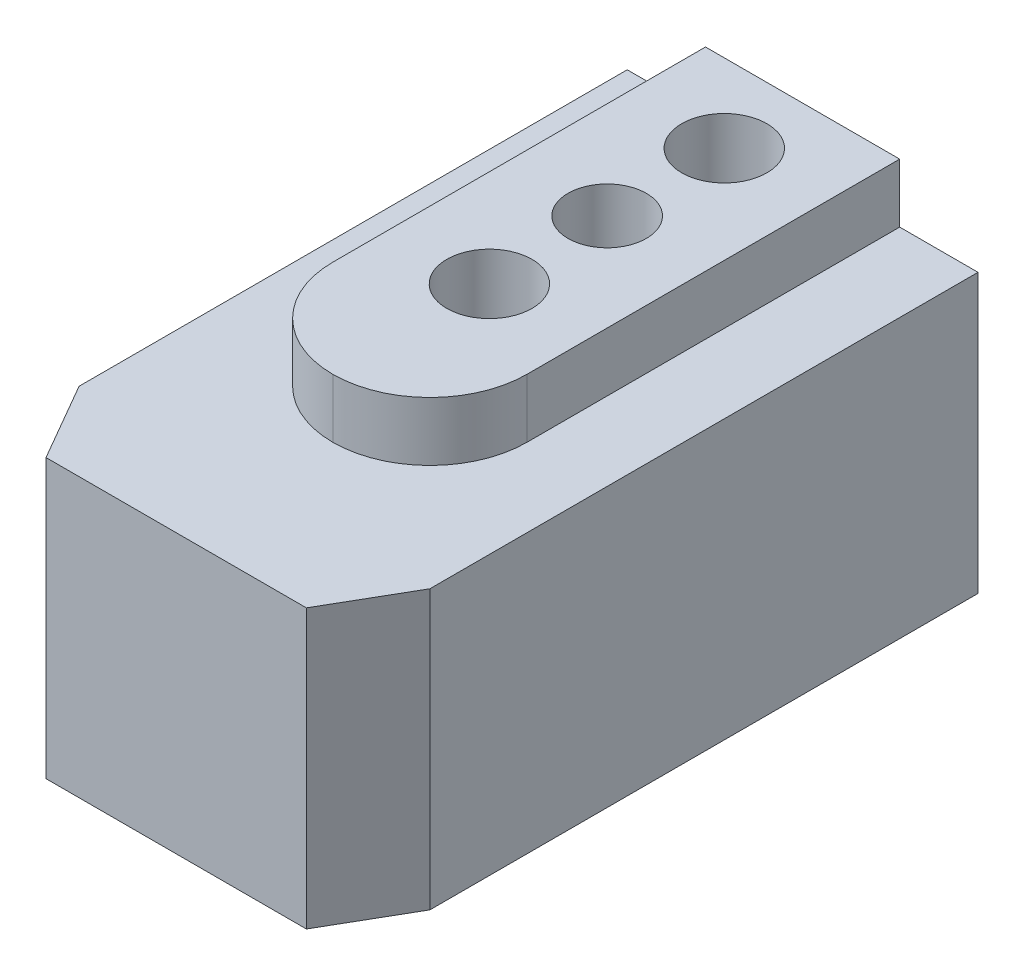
ISO-10303-21;
HEADER;
FILE_DESCRIPTION(('STEP AP214'),'2;1');
FILE_NAME('part.step','',(''),(''),'','','');
FILE_SCHEMA(('AUTOMOTIVE_DESIGN { 1 0 10303 214 1 1 1 1 }'));
ENDSEC;
DATA;
#1=APPLICATION_CONTEXT('core data for automotive mechanical design processes');
#2=APPLICATION_PROTOCOL_DEFINITION('international standard','automotive_design',2000,#1);
#3=PRODUCT_CONTEXT('',#1,'mechanical');
#4=PRODUCT('Part','Part','',(#3));
#5=PRODUCT_RELATED_PRODUCT_CATEGORY('part','',(#4));
#6=PRODUCT_DEFINITION_FORMATION('','',#4);
#7=PRODUCT_DEFINITION_CONTEXT('part definition',#1,'design');
#8=PRODUCT_DEFINITION('design','',#6,#7);
#9=PRODUCT_DEFINITION_SHAPE('','',#8);
#10=(LENGTH_UNIT() NAMED_UNIT(*) SI_UNIT(.MILLI.,.METRE.));
#11=(NAMED_UNIT(*) PLANE_ANGLE_UNIT() SI_UNIT($,.RADIAN.));
#12=(NAMED_UNIT(*) SI_UNIT($,.STERADIAN.) SOLID_ANGLE_UNIT());
#13=UNCERTAINTY_MEASURE_WITH_UNIT(LENGTH_MEASURE(1.E-05),#10,'distance_accuracy_value','');
#14=(GEOMETRIC_REPRESENTATION_CONTEXT(3) GLOBAL_UNCERTAINTY_ASSIGNED_CONTEXT((#13)) GLOBAL_UNIT_ASSIGNED_CONTEXT((#10,
#11,#12)) REPRESENTATION_CONTEXT('',''));
#15=CARTESIAN_POINT('',(0.,0.,0.));
#16=DIRECTION('',(0.,0.,1.));
#17=DIRECTION('',(1.,0.,0.));
#18=AXIS2_PLACEMENT_3D('',#15,#16,#17);
#19=CARTESIAN_POINT('',(-7.112,5.6388,-12.7));
#20=DIRECTION('',(1.,0.,0.));
#21=DIRECTION('',(0.,0.,-1.));
#22=AXIS2_PLACEMENT_3D('',#19,#20,#21);
#23=PLANE('',#22);
#24=DIRECTION('',(0.,0.,1.));
#25=VECTOR('',#24,1.);
#26=CARTESIAN_POINT('',(-7.112,-5.6388,-12.7));
#27=LINE('',#26,#25);
#28=CARTESIAN_POINT('',(-7.112,-5.6388,-12.7));
#29=VERTEX_POINT('',#28);
#30=CARTESIAN_POINT('',(-7.112,-5.6388,9.52499999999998));
#31=VERTEX_POINT('',#30);
#32=EDGE_CURVE('E228',#29,#31,#27,.T.);
#33=ORIENTED_EDGE('',*,*,#32,.T.);
#34=DIRECTION('',(0.,1.,0.));
#35=VECTOR('',#34,1.);
#36=CARTESIAN_POINT('',(-7.112,5.6388,9.52499999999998));
#37=LINE('',#36,#35);
#38=CARTESIAN_POINT('',(-7.11199999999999,5.6388,9.52500000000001));
#39=VERTEX_POINT('',#38);
#40=EDGE_CURVE('E45',#31,#39,#37,.T.);
#41=ORIENTED_EDGE('',*,*,#40,.T.);
#42=DIRECTION('',(0.,0.,1.));
#43=VECTOR('',#42,1.);
#44=CARTESIAN_POINT('',(-7.112,5.6388,-12.7));
#45=LINE('',#44,#43);
#46=CARTESIAN_POINT('',(-7.112,5.6388,-12.7));
#47=VERTEX_POINT('',#46);
#48=EDGE_CURVE('E186',#47,#39,#45,.T.);
#49=ORIENTED_EDGE('',*,*,#48,.F.);
#50=DIRECTION('',(0.,-1.,0.));
#51=VECTOR('',#50,1.);
#52=CARTESIAN_POINT('',(-7.112,5.6388,-12.7));
#53=LINE('',#52,#51);
#54=EDGE_CURVE('E237',#47,#29,#53,.T.);
#55=ORIENTED_EDGE('',*,*,#54,.T.);
#56=EDGE_LOOP('',(#33,#41,#49,#55));
#57=FACE_BOUND('',#56,.T.);
#58=ADVANCED_FACE('F37',(#57),#23,.F.);
#59=CARTESIAN_POINT('',(-7.112,5.6388,12.7));
#60=DIRECTION('',(0.,0.,-1.));
#61=DIRECTION('',(-1.,0.,0.));
#62=AXIS2_PLACEMENT_3D('',#59,#60,#61);
#63=PLANE('',#62);
#64=DIRECTION('',(1.,0.,0.));
#65=VECTOR('',#64,1.);
#66=CARTESIAN_POINT('',(-7.112,5.6388,12.7));
#67=LINE('',#66,#65);
#68=CARTESIAN_POINT('',(-5.27891289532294,5.6388,12.7));
#69=VERTEX_POINT('',#68);
#70=CARTESIAN_POINT('',(5.27891289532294,5.6388,12.7));
#71=VERTEX_POINT('',#70);
#72=EDGE_CURVE('E221',#69,#71,#67,.T.);
#73=ORIENTED_EDGE('',*,*,#72,.F.);
#74=DIRECTION('',(0.,-1.,0.));
#75=VECTOR('',#74,1.);
#76=CARTESIAN_POINT('',(-5.27891289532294,5.6388,12.7));
#77=LINE('',#76,#75);
#78=CARTESIAN_POINT('',(-5.27891289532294,-5.6388,12.7));
#79=VERTEX_POINT('',#78);
#80=EDGE_CURVE('E213',#69,#79,#77,.T.);
#81=ORIENTED_EDGE('',*,*,#80,.T.);
#82=DIRECTION('',(1.,0.,0.));
#83=VECTOR('',#82,1.);
#84=CARTESIAN_POINT('',(-7.112,-5.6388,12.7));
#85=LINE('',#84,#83);
#86=CARTESIAN_POINT('',(5.27891289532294,-5.6388,12.7));
#87=VERTEX_POINT('',#86);
#88=EDGE_CURVE('E220',#79,#87,#85,.T.);
#89=ORIENTED_EDGE('',*,*,#88,.T.);
#90=DIRECTION('',(0.,1.,0.));
#91=VECTOR('',#90,1.);
#92=CARTESIAN_POINT('',(5.27891289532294,5.6388,12.7));
#93=LINE('',#92,#91);
#94=EDGE_CURVE('E208',#87,#71,#93,.T.);
#95=ORIENTED_EDGE('',*,*,#94,.T.);
#96=EDGE_LOOP('',(#73,#81,#89,#95));
#97=FACE_BOUND('',#96,.T.);
#98=ADVANCED_FACE('F219',(#97),#63,.F.);
#99=CARTESIAN_POINT('',(7.112,5.6388,-12.7));
#100=DIRECTION('',(-1.,0.,0.));
#101=DIRECTION('',(0.,0.,1.));
#102=AXIS2_PLACEMENT_3D('',#99,#100,#101);
#103=PLANE('',#102);
#104=DIRECTION('',(0.,0.,-1.));
#105=VECTOR('',#104,1.);
#106=CARTESIAN_POINT('',(7.112,5.6388,-12.7));
#107=LINE('',#106,#105);
#108=CARTESIAN_POINT('',(7.11200000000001,5.6388,9.52499999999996));
#109=VERTEX_POINT('',#108);
#110=CARTESIAN_POINT('',(7.112,5.6388,-12.7));
#111=VERTEX_POINT('',#110);
#112=EDGE_CURVE('E251',#109,#111,#107,.T.);
#113=ORIENTED_EDGE('',*,*,#112,.F.);
#114=DIRECTION('',(0.,-1.,0.));
#115=VECTOR('',#114,1.);
#116=CARTESIAN_POINT('',(7.112,5.6388,9.52499999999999));
#117=LINE('',#116,#115);
#118=CARTESIAN_POINT('',(7.11200000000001,-5.6388,9.52499999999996));
#119=VERTEX_POINT('',#118);
#120=EDGE_CURVE('E200',#109,#119,#117,.T.);
#121=ORIENTED_EDGE('',*,*,#120,.T.);
#122=DIRECTION('',(0.,0.,-1.));
#123=VECTOR('',#122,1.);
#124=CARTESIAN_POINT('',(7.112,-5.6388,-12.7));
#125=LINE('',#124,#123);
#126=CARTESIAN_POINT('',(7.112,-5.6388,-12.7));
#127=VERTEX_POINT('',#126);
#128=EDGE_CURVE('E227',#119,#127,#125,.T.);
#129=ORIENTED_EDGE('',*,*,#128,.T.);
#130=DIRECTION('',(0.,-1.,0.));
#131=VECTOR('',#130,1.);
#132=CARTESIAN_POINT('',(7.112,5.6388,-12.7));
#133=LINE('',#132,#131);
#134=EDGE_CURVE('E240',#111,#127,#133,.T.);
#135=ORIENTED_EDGE('',*,*,#134,.F.);
#136=EDGE_LOOP('',(#113,#121,#129,#135));
#137=FACE_BOUND('',#136,.T.);
#138=ADVANCED_FACE('F274',(#137),#103,.F.);
#139=CARTESIAN_POINT('',(-7.112,5.6388,-12.7));
#140=DIRECTION('',(0.,0.,1.));
#141=DIRECTION('',(1.,0.,0.));
#142=AXIS2_PLACEMENT_3D('',#139,#140,#141);
#143=PLANE('',#142);
#144=CARTESIAN_POINT('',(-4.445,-2.4638,-12.7));
#145=DIRECTION('',(0.,0.,-1.));
#146=DIRECTION('',(-1.,0.,0.));
#147=AXIS2_PLACEMENT_3D('',#144,#145,#146);
#148=CIRCLE('',#147,1.19126);
#149=CARTESIAN_POINT('',(-5.63626,-2.4638,-12.7));
#150=VERTEX_POINT('',#149);
#151=EDGE_CURVE('E393',#150,#150,#148,.T.);
#152=ORIENTED_EDGE('',*,*,#151,.F.);
#153=EDGE_LOOP('',(#152));
#154=FACE_BOUND('',#153,.T.);
#155=CARTESIAN_POINT('',(4.445,-2.4638,-12.7));
#156=DIRECTION('',(0.,0.,-1.));
#157=DIRECTION('',(-1.,0.,0.));
#158=AXIS2_PLACEMENT_3D('',#155,#156,#157);
#159=CIRCLE('',#158,1.19126);
#160=CARTESIAN_POINT('',(3.25374,-2.4638,-12.7));
#161=VERTEX_POINT('',#160);
#162=EDGE_CURVE('E147',#161,#161,#159,.T.);
#163=ORIENTED_EDGE('',*,*,#162,.F.);
#164=EDGE_LOOP('',(#163));
#165=FACE_BOUND('',#164,.T.);
#166=CARTESIAN_POINT('',(4.445,2.3114,-12.7));
#167=DIRECTION('',(0.,0.,-1.));
#168=DIRECTION('',(-1.,0.,0.));
#169=AXIS2_PLACEMENT_3D('',#166,#167,#168);
#170=CIRCLE('',#169,1.72719999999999);
#171=CARTESIAN_POINT('',(2.71780000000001,2.3114,-12.7));
#172=VERTEX_POINT('',#171);
#173=EDGE_CURVE('E140',#172,#172,#170,.T.);
#174=ORIENTED_EDGE('',*,*,#173,.F.);
#175=EDGE_LOOP('',(#174));
#176=FACE_BOUND('',#175,.T.);
#177=CARTESIAN_POINT('',(-4.445,2.3114,-12.7));
#178=DIRECTION('',(0.,0.,-1.));
#179=DIRECTION('',(-1.,0.,0.));
#180=AXIS2_PLACEMENT_3D('',#177,#178,#179);
#181=CIRCLE('',#180,1.72719999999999);
#182=CARTESIAN_POINT('',(-6.17219999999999,2.3114,-12.7));
#183=VERTEX_POINT('',#182);
#184=EDGE_CURVE('E153',#183,#183,#181,.T.);
#185=ORIENTED_EDGE('',*,*,#184,.F.);
#186=EDGE_LOOP('',(#185));
#187=FACE_BOUND('',#186,.T.);
#188=DIRECTION('',(-1.,0.,0.));
#189=VECTOR('',#188,1.);
#190=CARTESIAN_POINT('',(-7.112,-5.6388,-12.7));
#191=LINE('',#190,#189);
#192=EDGE_CURVE('E230',#127,#29,#191,.T.);
#193=ORIENTED_EDGE('',*,*,#192,.T.);
#194=ORIENTED_EDGE('',*,*,#54,.F.);
#195=DIRECTION('',(-1.,0.,0.));
#196=VECTOR('',#195,1.);
#197=CARTESIAN_POINT('',(-7.112,5.6388,-12.7));
#198=LINE('',#197,#196);
#199=CARTESIAN_POINT('',(-3.937,5.6388,-12.7));
#200=VERTEX_POINT('',#199);
#201=EDGE_CURVE('E247',#200,#47,#198,.T.);
#202=ORIENTED_EDGE('',*,*,#201,.F.);
#203=DIRECTION('',(0.,-1.,0.));
#204=VECTOR('',#203,1.);
#205=CARTESIAN_POINT('',(-3.937,8.0264,-12.7));
#206=LINE('',#205,#204);
#207=CARTESIAN_POINT('',(-3.937,8.0264,-12.7));
#208=VERTEX_POINT('',#207);
#209=EDGE_CURVE('E183',#208,#200,#206,.T.);
#210=ORIENTED_EDGE('',*,*,#209,.F.);
#211=DIRECTION('',(-1.,0.,0.));
#212=VECTOR('',#211,1.);
#213=CARTESIAN_POINT('',(3.937,8.0264,-12.7));
#214=LINE('',#213,#212);
#215=CARTESIAN_POINT('',(3.937,8.0264,-12.7));
#216=VERTEX_POINT('',#215);
#217=EDGE_CURVE('E177',#216,#208,#214,.T.);
#218=ORIENTED_EDGE('',*,*,#217,.F.);
#219=DIRECTION('',(0.,-1.,0.));
#220=VECTOR('',#219,1.);
#221=CARTESIAN_POINT('',(3.937,8.0264,-12.7));
#222=LINE('',#221,#220);
#223=CARTESIAN_POINT('',(3.93699999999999,5.6388,-12.7));
#224=VERTEX_POINT('',#223);
#225=EDGE_CURVE('E232',#216,#224,#222,.T.);
#226=ORIENTED_EDGE('',*,*,#225,.T.);
#227=EDGE_CURVE('E241',#111,#224,#198,.T.);
#228=ORIENTED_EDGE('',*,*,#227,.F.);
#229=ORIENTED_EDGE('',*,*,#134,.T.);
#230=EDGE_LOOP('',(#193,#194,#202,#210,#218,#226,#228,#229));
#231=FACE_BOUND('',#230,.T.);
#232=ADVANCED_FACE('F307',(#154,#165,#176,#187,#231),#143,.F.);
#233=CARTESIAN_POINT('',(-7.112,5.6388,12.7));
#234=DIRECTION('',(0.,1.,0.));
#235=DIRECTION('',(0.,0.,1.));
#236=AXIS2_PLACEMENT_3D('',#233,#234,#235);
#237=PLANE('',#236);
#238=ORIENTED_EDGE('',*,*,#48,.T.);
#239=DIRECTION('',(-0.499999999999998,0.,-0.86602540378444));
#240=VECTOR('',#239,1.);
#241=CARTESIAN_POINT('',(-5.7371846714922,5.6388,11.90625));
#242=LINE('',#241,#240);
#243=EDGE_CURVE('E11',#39,#69,#242,.F.);
#244=ORIENTED_EDGE('',*,*,#243,.T.);
#245=ORIENTED_EDGE('',*,*,#72,.T.);
#246=DIRECTION('',(-0.499999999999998,0.,0.86602540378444));
#247=VECTOR('',#246,1.);
#248=CARTESIAN_POINT('',(2.18118467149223,5.6388,18.0654226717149));
#249=LINE('',#248,#247);
#250=EDGE_CURVE('E211',#71,#109,#249,.F.);
#251=ORIENTED_EDGE('',*,*,#250,.T.);
#252=ORIENTED_EDGE('',*,*,#112,.T.);
#253=ORIENTED_EDGE('',*,*,#227,.T.);
#254=DIRECTION('',(0.,0.,-1.));
#255=VECTOR('',#254,1.);
#256=CARTESIAN_POINT('',(3.937,5.6388,-12.7));
#257=LINE('',#256,#255);
#258=CARTESIAN_POINT('',(3.937,5.6388,2.413));
#259=VERTEX_POINT('',#258);
#260=EDGE_CURVE('E189',#259,#224,#257,.T.);
#261=ORIENTED_EDGE('',*,*,#260,.F.);
#262=CARTESIAN_POINT('',(0.,5.6388,2.413));
#263=DIRECTION('',(0.,1.,0.));
#264=DIRECTION('',(0.,0.,1.));
#265=AXIS2_PLACEMENT_3D('',#262,#263,#264);
#266=CIRCLE('',#265,3.937);
#267=CARTESIAN_POINT('',(0.,5.6388,6.35));
#268=VERTEX_POINT('',#267);
#269=EDGE_CURVE('E198',#259,#268,#266,.F.);
#270=ORIENTED_EDGE('',*,*,#269,.T.);
#271=CARTESIAN_POINT('',(0.,5.6388,2.413));
#272=DIRECTION('',(0.,1.,0.));
#273=DIRECTION('',(0.,0.,1.));
#274=AXIS2_PLACEMENT_3D('',#271,#272,#273);
#275=CIRCLE('',#274,3.937);
#276=CARTESIAN_POINT('',(-3.937,5.6388,2.413));
#277=VERTEX_POINT('',#276);
#278=EDGE_CURVE('E196',#268,#277,#275,.F.);
#279=ORIENTED_EDGE('',*,*,#278,.T.);
#280=DIRECTION('',(0.,0.,1.));
#281=VECTOR('',#280,1.);
#282=CARTESIAN_POINT('',(-3.937,5.6388,-12.7));
#283=LINE('',#282,#281);
#284=EDGE_CURVE('E178',#200,#277,#283,.T.);
#285=ORIENTED_EDGE('',*,*,#284,.F.);
#286=ORIENTED_EDGE('',*,*,#201,.T.);
#287=EDGE_LOOP('',(#238,#244,#245,#251,#252,#253,#261,#270,#279,#285,#286));
#288=FACE_BOUND('',#287,.T.);
#289=ADVANCED_FACE('F254',(#288),#237,.T.);
#290=CARTESIAN_POINT('',(-7.112,-5.6388,12.7));
#291=DIRECTION('',(0.,1.,0.));
#292=DIRECTION('',(0.,0.,1.));
#293=AXIS2_PLACEMENT_3D('',#290,#291,#292);
#294=PLANE('',#293);
#295=ORIENTED_EDGE('',*,*,#88,.F.);
#296=DIRECTION('',(0.499999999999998,0.,0.86602540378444));
#297=VECTOR('',#296,1.);
#298=CARTESIAN_POINT('',(-5.27891289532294,-5.6388,12.7));
#299=LINE('',#298,#297);
#300=EDGE_CURVE('E59',#79,#31,#299,.F.);
#301=ORIENTED_EDGE('',*,*,#300,.T.);
#302=ORIENTED_EDGE('',*,*,#32,.F.);
#303=ORIENTED_EDGE('',*,*,#192,.F.);
#304=ORIENTED_EDGE('',*,*,#128,.F.);
#305=DIRECTION('',(0.499999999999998,0.,-0.86602540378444));
#306=VECTOR('',#305,1.);
#307=CARTESIAN_POINT('',(7.112,-5.6388,9.52499999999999));
#308=LINE('',#307,#306);
#309=EDGE_CURVE('E205',#119,#87,#308,.F.);
#310=ORIENTED_EDGE('',*,*,#309,.T.);
#311=EDGE_LOOP('',(#295,#301,#302,#303,#304,#310));
#312=FACE_BOUND('',#311,.T.);
#313=ADVANCED_FACE('F224',(#312),#294,.F.);
#314=CARTESIAN_POINT('',(3.937,8.0264,-12.7));
#315=DIRECTION('',(-1.,0.,0.));
#316=DIRECTION('',(0.,0.,1.));
#317=AXIS2_PLACEMENT_3D('',#314,#315,#316);
#318=PLANE('',#317);
#319=DIRECTION('',(0.,0.,-1.));
#320=VECTOR('',#319,1.);
#321=CARTESIAN_POINT('',(3.937,8.0264,-12.7));
#322=LINE('',#321,#320);
#323=CARTESIAN_POINT('',(3.937,8.0264,2.413));
#324=VERTEX_POINT('',#323);
#325=EDGE_CURVE('E175',#324,#216,#322,.T.);
#326=ORIENTED_EDGE('',*,*,#325,.F.);
#327=DIRECTION('',(0.,-1.,0.));
#328=VECTOR('',#327,1.);
#329=CARTESIAN_POINT('',(3.937,8.0264,2.413));
#330=LINE('',#329,#328);
#331=EDGE_CURVE('E194',#324,#259,#330,.T.);
#332=ORIENTED_EDGE('',*,*,#331,.T.);
#333=ORIENTED_EDGE('',*,*,#260,.T.);
#334=ORIENTED_EDGE('',*,*,#225,.F.);
#335=EDGE_LOOP('',(#326,#332,#333,#334));
#336=FACE_BOUND('',#335,.T.);
#337=ADVANCED_FACE('F299',(#336),#318,.F.);
#338=CARTESIAN_POINT('',(-3.937,8.0264,-12.7));
#339=DIRECTION('',(1.,0.,0.));
#340=DIRECTION('',(0.,0.,-1.));
#341=AXIS2_PLACEMENT_3D('',#338,#339,#340);
#342=PLANE('',#341);
#343=ORIENTED_EDGE('',*,*,#284,.T.);
#344=DIRECTION('',(0.,-1.,0.));
#345=VECTOR('',#344,1.);
#346=CARTESIAN_POINT('',(-3.937,8.0264,2.413));
#347=LINE('',#346,#345);
#348=CARTESIAN_POINT('',(-3.937,8.0264,2.413));
#349=VERTEX_POINT('',#348);
#350=EDGE_CURVE('E244',#277,#349,#347,.F.);
#351=ORIENTED_EDGE('',*,*,#350,.T.);
#352=DIRECTION('',(0.,0.,1.));
#353=VECTOR('',#352,1.);
#354=CARTESIAN_POINT('',(-3.937,8.0264,-12.7));
#355=LINE('',#354,#353);
#356=EDGE_CURVE('E180',#208,#349,#355,.T.);
#357=ORIENTED_EDGE('',*,*,#356,.F.);
#358=ORIENTED_EDGE('',*,*,#209,.T.);
#359=EDGE_LOOP('',(#343,#351,#357,#358));
#360=FACE_BOUND('',#359,.T.);
#361=ADVANCED_FACE('F288',(#360),#342,.F.);
#362=CARTESIAN_POINT('',(3.937,8.0264,6.35));
#363=DIRECTION('',(0.,-1.,0.));
#364=DIRECTION('',(0.,0.,-1.));
#365=AXIS2_PLACEMENT_3D('',#362,#363,#364);
#366=PLANE('',#365);
#367=CARTESIAN_POINT('',(0.,8.0264,-4.77520000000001));
#368=DIRECTION('',(0.,1.,0.));
#369=DIRECTION('',(0.,0.,1.));
#370=AXIS2_PLACEMENT_3D('',#367,#368,#369);
#371=CIRCLE('',#370,1.5875);
#372=CARTESIAN_POINT('',(0.,8.0264,-3.18770000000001));
#373=VERTEX_POINT('',#372);
#374=EDGE_CURVE('E156',#373,#373,#371,.T.);
#375=ORIENTED_EDGE('',*,*,#374,.F.);
#376=EDGE_LOOP('',(#375));
#377=FACE_BOUND('',#376,.T.);
#378=CARTESIAN_POINT('',(0.,8.0264,0.));
#379=DIRECTION('',(0.,1.,0.));
#380=DIRECTION('',(0.,0.,1.));
#381=AXIS2_PLACEMENT_3D('',#378,#379,#380);
#382=CIRCLE('',#381,1.7272);
#383=CARTESIAN_POINT('',(0.,8.0264,1.7272));
#384=VERTEX_POINT('',#383);
#385=EDGE_CURVE('E165',#384,#384,#382,.T.);
#386=ORIENTED_EDGE('',*,*,#385,.F.);
#387=EDGE_LOOP('',(#386));
#388=FACE_BOUND('',#387,.T.);
#389=CARTESIAN_POINT('',(0.,8.0264,-9.525));
#390=DIRECTION('',(0.,1.,0.));
#391=DIRECTION('',(0.,0.,1.));
#392=AXIS2_PLACEMENT_3D('',#389,#390,#391);
#393=CIRCLE('',#392,1.7272);
#394=CARTESIAN_POINT('',(0.,8.0264,-7.7978));
#395=VERTEX_POINT('',#394);
#396=EDGE_CURVE('E171',#395,#395,#393,.T.);
#397=ORIENTED_EDGE('',*,*,#396,.F.);
#398=EDGE_LOOP('',(#397));
#399=FACE_BOUND('',#398,.T.);
#400=ORIENTED_EDGE('',*,*,#356,.T.);
#401=CARTESIAN_POINT('',(0.,8.0264,2.413));
#402=DIRECTION('',(0.,-1.,0.));
#403=DIRECTION('',(0.,0.,-1.));
#404=AXIS2_PLACEMENT_3D('',#401,#402,#403);
#405=CIRCLE('',#404,3.937);
#406=CARTESIAN_POINT('',(0.,8.0264,6.35));
#407=VERTEX_POINT('',#406);
#408=EDGE_CURVE('E192',#349,#407,#405,.F.);
#409=ORIENTED_EDGE('',*,*,#408,.T.);
#410=CARTESIAN_POINT('',(0.,8.0264,2.413));
#411=DIRECTION('',(0.,-1.,0.));
#412=DIRECTION('',(0.,0.,-1.));
#413=AXIS2_PLACEMENT_3D('',#410,#411,#412);
#414=CIRCLE('',#413,3.937);
#415=EDGE_CURVE('E295',#407,#324,#414,.F.);
#416=ORIENTED_EDGE('',*,*,#415,.T.);
#417=ORIENTED_EDGE('',*,*,#325,.T.);
#418=ORIENTED_EDGE('',*,*,#217,.T.);
#419=EDGE_LOOP('',(#400,#409,#416,#417,#418));
#420=FACE_BOUND('',#419,.T.);
#421=ADVANCED_FACE('F283',(#377,#388,#399,#420),#366,.F.);
#422=CARTESIAN_POINT('',(0.,8.0264,2.413));
#423=DIRECTION('',(0.,-1.,0.));
#424=DIRECTION('',(0.,0.,-1.));
#425=AXIS2_PLACEMENT_3D('',#422,#423,#424);
#426=CYLINDRICAL_SURFACE('',#425,3.937);
#427=ORIENTED_EDGE('',*,*,#331,.F.);
#428=ORIENTED_EDGE('',*,*,#415,.F.);
#429=DIRECTION('',(0.,-1.,0.));
#430=VECTOR('',#429,1.);
#431=CARTESIAN_POINT('',(0.,8.0264,6.35));
#432=LINE('',#431,#430);
#433=EDGE_CURVE('E174',#268,#407,#432,.F.);
#434=ORIENTED_EDGE('',*,*,#433,.F.);
#435=ORIENTED_EDGE('',*,*,#269,.F.);
#436=EDGE_LOOP('',(#427,#428,#434,#435));
#437=FACE_BOUND('',#436,.T.);
#438=ADVANCED_FACE('F280',(#437),#426,.T.);
#439=CARTESIAN_POINT('',(0.,8.0264,2.413));
#440=DIRECTION('',(0.,-1.,0.));
#441=DIRECTION('',(0.,0.,-1.));
#442=AXIS2_PLACEMENT_3D('',#439,#440,#441);
#443=CYLINDRICAL_SURFACE('',#442,3.937);
#444=ORIENTED_EDGE('',*,*,#408,.F.);
#445=ORIENTED_EDGE('',*,*,#350,.F.);
#446=ORIENTED_EDGE('',*,*,#278,.F.);
#447=ORIENTED_EDGE('',*,*,#433,.T.);
#448=EDGE_LOOP('',(#444,#445,#446,#447));
#449=FACE_BOUND('',#448,.T.);
#450=ADVANCED_FACE('F267',(#449),#443,.T.);
#451=CARTESIAN_POINT('',(7.112,5.6388,9.52499999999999));
#452=DIRECTION('',(-0.86602540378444,0.,-0.499999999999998));
#453=DIRECTION('',(-0.499999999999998,0.,0.86602540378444));
#454=AXIS2_PLACEMENT_3D('',#451,#452,#453);
#455=PLANE('',#454);
#456=ORIENTED_EDGE('',*,*,#250,.F.);
#457=ORIENTED_EDGE('',*,*,#94,.F.);
#458=ORIENTED_EDGE('',*,*,#309,.F.);
#459=ORIENTED_EDGE('',*,*,#120,.F.);
#460=EDGE_LOOP('',(#456,#457,#458,#459));
#461=FACE_BOUND('',#460,.T.);
#462=ADVANCED_FACE('F259',(#461),#455,.F.);
#463=CARTESIAN_POINT('',(-5.27891289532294,5.6388,12.7));
#464=DIRECTION('',(0.86602540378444,0.,-0.499999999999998));
#465=DIRECTION('',(-0.499999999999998,0.,-0.86602540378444));
#466=AXIS2_PLACEMENT_3D('',#463,#464,#465);
#467=PLANE('',#466);
#468=ORIENTED_EDGE('',*,*,#243,.F.);
#469=ORIENTED_EDGE('',*,*,#40,.F.);
#470=ORIENTED_EDGE('',*,*,#300,.F.);
#471=ORIENTED_EDGE('',*,*,#80,.F.);
#472=EDGE_LOOP('',(#468,#469,#470,#471));
#473=FACE_BOUND('',#472,.T.);
#474=ADVANCED_FACE('F39',(#473),#467,.F.);
#475=CARTESIAN_POINT('',(0.,8.0264,-9.525));
#476=DIRECTION('',(0.,1.,0.));
#477=DIRECTION('',(0.,0.,1.));
#478=AXIS2_PLACEMENT_3D('',#475,#476,#477);
#479=CYLINDRICAL_SURFACE('',#478,1.7272);
#480=CARTESIAN_POINT('',(0.,-4.2672,-9.525));
#481=DIRECTION('',(0.,1.,0.));
#482=DIRECTION('',(0.,0.,1.));
#483=AXIS2_PLACEMENT_3D('',#480,#481,#482);
#484=CIRCLE('',#483,1.7272);
#485=CARTESIAN_POINT('',(0.,-4.2672,-7.7978));
#486=VERTEX_POINT('',#485);
#487=EDGE_CURVE('E168',#486,#486,#484,.T.);
#488=ORIENTED_EDGE('',*,*,#487,.F.);
#489=EDGE_LOOP('',(#488));
#490=FACE_BOUND('',#489,.T.);
#491=ORIENTED_EDGE('',*,*,#396,.T.);
#492=EDGE_LOOP('',(#491));
#493=FACE_BOUND('',#492,.T.);
#494=ADVANCED_FACE('F258',(#490,#493),#479,.F.);
#495=CARTESIAN_POINT('',(0.,-4.2672,-9.525));
#496=DIRECTION('',(0.,1.,0.));
#497=DIRECTION('',(0.,0.,1.));
#498=AXIS2_PLACEMENT_3D('',#495,#496,#497);
#499=CONICAL_SURFACE('',#498,1.7272,1.02974425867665);
#500=CARTESIAN_POINT('',(0.,-5.3050064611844,-9.525));
#501=VERTEX_POINT('',#500);
#502=VERTEX_LOOP('',#501);
#503=FACE_BOUND('',#502,.T.);
#504=ORIENTED_EDGE('',*,*,#487,.T.);
#505=EDGE_LOOP('',(#504));
#506=FACE_BOUND('',#505,.T.);
#507=ADVANCED_FACE('F264',(#503,#506),#499,.F.);
#508=CARTESIAN_POINT('',(0.,8.0264,0.));
#509=DIRECTION('',(0.,1.,0.));
#510=DIRECTION('',(0.,0.,1.));
#511=AXIS2_PLACEMENT_3D('',#508,#509,#510);
#512=CYLINDRICAL_SURFACE('',#511,1.7272);
#513=CARTESIAN_POINT('',(0.,-4.2672,0.));
#514=DIRECTION('',(0.,1.,0.));
#515=DIRECTION('',(0.,0.,1.));
#516=AXIS2_PLACEMENT_3D('',#513,#514,#515);
#517=CIRCLE('',#516,1.7272);
#518=CARTESIAN_POINT('',(0.,-4.2672,1.7272));
#519=VERTEX_POINT('',#518);
#520=EDGE_CURVE('E160',#519,#519,#517,.T.);
#521=ORIENTED_EDGE('',*,*,#520,.F.);
#522=EDGE_LOOP('',(#521));
#523=FACE_BOUND('',#522,.T.);
#524=ORIENTED_EDGE('',*,*,#385,.T.);
#525=EDGE_LOOP('',(#524));
#526=FACE_BOUND('',#525,.T.);
#527=ADVANCED_FACE('F347',(#523,#526),#512,.F.);
#528=CARTESIAN_POINT('',(0.,-4.2672,0.));
#529=DIRECTION('',(0.,1.,0.));
#530=DIRECTION('',(0.,0.,1.));
#531=AXIS2_PLACEMENT_3D('',#528,#529,#530);
#532=CONICAL_SURFACE('',#531,1.7272,1.02974425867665);
#533=CARTESIAN_POINT('',(0.,-5.3050064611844,0.));
#534=VERTEX_POINT('',#533);
#535=VERTEX_LOOP('',#534);
#536=FACE_BOUND('',#535,.T.);
#537=ORIENTED_EDGE('',*,*,#520,.T.);
#538=EDGE_LOOP('',(#537));
#539=FACE_BOUND('',#538,.T.);
#540=ADVANCED_FACE('F351',(#536,#539),#532,.F.);
#541=CARTESIAN_POINT('',(0.,1.6764,-4.77520000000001));
#542=DIRECTION('',(0.,1.,0.));
#543=DIRECTION('',(0.,0.,1.));
#544=AXIS2_PLACEMENT_3D('',#541,#542,#543);
#545=CYLINDRICAL_SURFACE('',#544,1.5875);
#546=CARTESIAN_POINT('',(0.,1.6764,-4.77520000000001));
#547=DIRECTION('',(0.,1.,0.));
#548=DIRECTION('',(0.,0.,1.));
#549=AXIS2_PLACEMENT_3D('',#546,#547,#548);
#550=CIRCLE('',#549,1.5875);
#551=CARTESIAN_POINT('',(0.,1.6764,-3.18770000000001));
#552=VERTEX_POINT('',#551);
#553=EDGE_CURVE('E157',#552,#552,#550,.T.);
#554=ORIENTED_EDGE('',*,*,#553,.F.);
#555=EDGE_LOOP('',(#554));
#556=FACE_BOUND('',#555,.T.);
#557=ORIENTED_EDGE('',*,*,#374,.T.);
#558=EDGE_LOOP('',(#557));
#559=FACE_BOUND('',#558,.T.);
#560=ADVANCED_FACE('F355',(#556,#559),#545,.F.);
#561=CARTESIAN_POINT('',(0.,1.6764,-4.77520000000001));
#562=DIRECTION('',(0.,1.,0.));
#563=DIRECTION('',(0.,0.,1.));
#564=AXIS2_PLACEMENT_3D('',#561,#562,#563);
#565=PLANE('',#564);
#566=ORIENTED_EDGE('',*,*,#553,.T.);
#567=EDGE_LOOP('',(#566));
#568=FACE_BOUND('',#567,.T.);
#569=ADVANCED_FACE('F359',(#568),#565,.T.);
#570=CARTESIAN_POINT('',(-4.445,2.3114,-12.7));
#571=DIRECTION('',(0.,0.,-1.));
#572=DIRECTION('',(-1.,0.,0.));
#573=AXIS2_PLACEMENT_3D('',#570,#571,#572);
#574=CYLINDRICAL_SURFACE('',#573,1.72719999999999);
#575=CARTESIAN_POINT('',(-4.445,2.3114,-0.405993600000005));
#576=DIRECTION('',(0.,0.,-1.));
#577=DIRECTION('',(-1.,0.,0.));
#578=AXIS2_PLACEMENT_3D('',#575,#576,#577);
#579=CIRCLE('',#578,1.7272);
#580=CARTESIAN_POINT('',(-6.17219999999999,2.3114,-0.405993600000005));
#581=VERTEX_POINT('',#580);
#582=EDGE_CURVE('E144',#581,#581,#579,.T.);
#583=ORIENTED_EDGE('',*,*,#582,.F.);
#584=EDGE_LOOP('',(#583));
#585=FACE_BOUND('',#584,.T.);
#586=ORIENTED_EDGE('',*,*,#184,.T.);
#587=EDGE_LOOP('',(#586));
#588=FACE_BOUND('',#587,.T.);
#589=ADVANCED_FACE('F363',(#585,#588),#574,.F.);
#590=CARTESIAN_POINT('',(-4.445,2.3114,-0.405993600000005));
#591=DIRECTION('',(0.,0.,-1.));
#592=DIRECTION('',(-1.,0.,0.));
#593=AXIS2_PLACEMENT_3D('',#590,#591,#592);
#594=CONICAL_SURFACE('',#593,1.7272,1.02974425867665);
#595=CARTESIAN_POINT('',(-4.445,2.3114,0.631812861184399));
#596=VERTEX_POINT('',#595);
#597=VERTEX_LOOP('',#596);
#598=FACE_BOUND('',#597,.T.);
#599=ORIENTED_EDGE('',*,*,#582,.T.);
#600=EDGE_LOOP('',(#599));
#601=FACE_BOUND('',#600,.T.);
#602=ADVANCED_FACE('F367',(#598,#601),#594,.F.);
#603=CARTESIAN_POINT('',(4.445,2.3114,-12.7));
#604=DIRECTION('',(0.,0.,-1.));
#605=DIRECTION('',(-1.,0.,0.));
#606=AXIS2_PLACEMENT_3D('',#603,#604,#605);
#607=CYLINDRICAL_SURFACE('',#606,1.72719999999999);
#608=CARTESIAN_POINT('',(4.445,2.3114,-0.405993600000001));
#609=DIRECTION('',(0.,0.,-1.));
#610=DIRECTION('',(-1.,0.,0.));
#611=AXIS2_PLACEMENT_3D('',#608,#609,#610);
#612=CIRCLE('',#611,1.7272);
#613=CARTESIAN_POINT('',(2.71780000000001,2.3114,-0.405993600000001));
#614=VERTEX_POINT('',#613);
#615=EDGE_CURVE('E138',#614,#614,#612,.T.);
#616=ORIENTED_EDGE('',*,*,#615,.F.);
#617=EDGE_LOOP('',(#616));
#618=FACE_BOUND('',#617,.T.);
#619=ORIENTED_EDGE('',*,*,#173,.T.);
#620=EDGE_LOOP('',(#619));
#621=FACE_BOUND('',#620,.T.);
#622=ADVANCED_FACE('F134',(#618,#621),#607,.F.);
#623=CARTESIAN_POINT('',(4.445,2.3114,-0.405993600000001));
#624=DIRECTION('',(0.,0.,-1.));
#625=DIRECTION('',(-1.,0.,0.));
#626=AXIS2_PLACEMENT_3D('',#623,#624,#625);
#627=CONICAL_SURFACE('',#626,1.7272,1.02974425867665);
#628=CARTESIAN_POINT('',(4.445,2.3114,0.631812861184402));
#629=VERTEX_POINT('',#628);
#630=VERTEX_LOOP('',#629);
#631=FACE_BOUND('',#630,.T.);
#632=ORIENTED_EDGE('',*,*,#615,.T.);
#633=EDGE_LOOP('',(#632));
#634=FACE_BOUND('',#633,.T.);
#635=ADVANCED_FACE('F130',(#631,#634),#627,.F.);
#636=CARTESIAN_POINT('',(4.445,-2.4638,-6.35));
#637=DIRECTION('',(0.,0.,-1.));
#638=DIRECTION('',(-1.,0.,0.));
#639=AXIS2_PLACEMENT_3D('',#636,#637,#638);
#640=CYLINDRICAL_SURFACE('',#639,1.19126);
#641=CARTESIAN_POINT('',(4.445,-2.4638,-6.35));
#642=DIRECTION('',(0.,0.,-1.));
#643=DIRECTION('',(-1.,0.,0.));
#644=AXIS2_PLACEMENT_3D('',#641,#642,#643);
#645=CIRCLE('',#644,1.19126);
#646=CARTESIAN_POINT('',(3.25374,-2.4638,-6.35));
#647=VERTEX_POINT('',#646);
#648=EDGE_CURVE('E141',#647,#647,#645,.T.);
#649=ORIENTED_EDGE('',*,*,#648,.F.);
#650=EDGE_LOOP('',(#649));
#651=FACE_BOUND('',#650,.T.);
#652=ORIENTED_EDGE('',*,*,#162,.T.);
#653=EDGE_LOOP('',(#652));
#654=FACE_BOUND('',#653,.T.);
#655=ADVANCED_FACE('F133',(#651,#654),#640,.F.);
#656=CARTESIAN_POINT('',(4.445,-2.4638,-6.35));
#657=DIRECTION('',(0.,0.,-1.));
#658=DIRECTION('',(-1.,0.,0.));
#659=AXIS2_PLACEMENT_3D('',#656,#657,#658);
#660=PLANE('',#659);
#661=ORIENTED_EDGE('',*,*,#648,.T.);
#662=EDGE_LOOP('',(#661));
#663=FACE_BOUND('',#662,.T.);
#664=ADVANCED_FACE('F376',(#663),#660,.T.);
#665=CARTESIAN_POINT('',(-4.445,-2.4638,-6.35));
#666=DIRECTION('',(0.,0.,-1.));
#667=DIRECTION('',(-1.,0.,0.));
#668=AXIS2_PLACEMENT_3D('',#665,#666,#667);
#669=CYLINDRICAL_SURFACE('',#668,1.19126);
#670=CARTESIAN_POINT('',(-4.445,-2.4638,-6.35));
#671=DIRECTION('',(0.,0.,-1.));
#672=DIRECTION('',(-1.,0.,0.));
#673=AXIS2_PLACEMENT_3D('',#670,#671,#672);
#674=CIRCLE('',#673,1.19126);
#675=CARTESIAN_POINT('',(-5.63626,-2.4638,-6.35));
#676=VERTEX_POINT('',#675);
#677=EDGE_CURVE('E392',#676,#676,#674,.T.);
#678=ORIENTED_EDGE('',*,*,#677,.F.);
#679=EDGE_LOOP('',(#678));
#680=FACE_BOUND('',#679,.T.);
#681=ORIENTED_EDGE('',*,*,#151,.T.);
#682=EDGE_LOOP('',(#681));
#683=FACE_BOUND('',#682,.T.);
#684=ADVANCED_FACE('F380',(#680,#683),#669,.F.);
#685=CARTESIAN_POINT('',(-4.445,-2.4638,-6.35));
#686=DIRECTION('',(0.,0.,-1.));
#687=DIRECTION('',(-1.,0.,0.));
#688=AXIS2_PLACEMENT_3D('',#685,#686,#687);
#689=PLANE('',#688);
#690=ORIENTED_EDGE('',*,*,#677,.T.);
#691=EDGE_LOOP('',(#690));
#692=FACE_BOUND('',#691,.T.);
#693=ADVANCED_FACE('F384',(#692),#689,.T.);
#694=CLOSED_SHELL('',(#58,#98,#138,#232,#289,#313,#337,#361,#421,#438,#450,#462,#474,#494,#507,
#527,#540,#560,#569,#589,#602,#622,#635,#655,#664,#684,#693));
#695=MANIFOLD_SOLID_BREP('B2',#694);
#696=ADVANCED_BREP_SHAPE_REPRESENTATION('',(#18,#695),#14);
#697=SHAPE_DEFINITION_REPRESENTATION(#9,#696);
ENDSEC;
END-ISO-10303-21;
